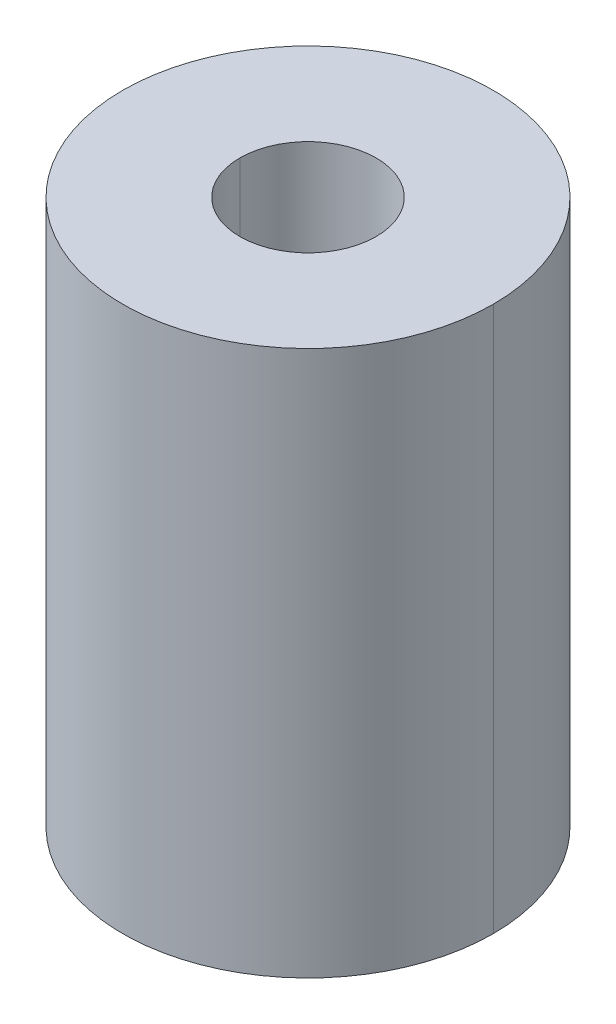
ISO-10303-21;
HEADER;
FILE_DESCRIPTION(('STEP AP214'),'2;1');
FILE_NAME('part.step','',(''),(''),'','','');
FILE_SCHEMA(('AUTOMOTIVE_DESIGN { 1 0 10303 214 1 1 1 1 }'));
ENDSEC;
DATA;
#1=APPLICATION_CONTEXT('core data for automotive mechanical design processes');
#2=APPLICATION_PROTOCOL_DEFINITION('international standard','automotive_design',2000,#1);
#3=PRODUCT_CONTEXT('',#1,'mechanical');
#4=PRODUCT('Part','Part','',(#3));
#5=PRODUCT_RELATED_PRODUCT_CATEGORY('part','',(#4));
#6=PRODUCT_DEFINITION_FORMATION('','',#4);
#7=PRODUCT_DEFINITION_CONTEXT('part definition',#1,'design');
#8=PRODUCT_DEFINITION('design','',#6,#7);
#9=PRODUCT_DEFINITION_SHAPE('','',#8);
#10=(LENGTH_UNIT() NAMED_UNIT(*) SI_UNIT(.MILLI.,.METRE.));
#11=(NAMED_UNIT(*) PLANE_ANGLE_UNIT() SI_UNIT($,.RADIAN.));
#12=(NAMED_UNIT(*) SI_UNIT($,.STERADIAN.) SOLID_ANGLE_UNIT());
#13=UNCERTAINTY_MEASURE_WITH_UNIT(LENGTH_MEASURE(1.E-05),#10,'distance_accuracy_value','');
#14=(GEOMETRIC_REPRESENTATION_CONTEXT(3) GLOBAL_UNCERTAINTY_ASSIGNED_CONTEXT((#13)) GLOBAL_UNIT_ASSIGNED_CONTEXT((#10,
#11,#12)) REPRESENTATION_CONTEXT('',''));
#15=CARTESIAN_POINT('',(0.,0.,0.));
#16=DIRECTION('',(0.,0.,1.));
#17=DIRECTION('',(1.,0.,0.));
#18=AXIS2_PLACEMENT_3D('',#15,#16,#17);
#19=CARTESIAN_POINT('',(0.,6.35,0.));
#20=DIRECTION('',(0.,-1.,0.));
#21=DIRECTION('',(0.,0.,-1.));
#22=AXIS2_PLACEMENT_3D('',#19,#20,#21);
#23=PLANE('',#22);
#24=CARTESIAN_POINT('',(0.,6.35,0.));
#25=DIRECTION('',(0.,-1.,0.));
#26=DIRECTION('',(0.,0.,-1.));
#27=AXIS2_PLACEMENT_3D('',#24,#25,#26);
#28=CIRCLE('',#27,6.35);
#29=CARTESIAN_POINT('',(6.35,6.35,0.));
#30=VERTEX_POINT('',#29);
#31=CARTESIAN_POINT('',(-6.35,6.35,0.));
#32=VERTEX_POINT('',#31);
#33=EDGE_CURVE('E66',#30,#32,#28,.F.);
#34=ORIENTED_EDGE('',*,*,#33,.T.);
#35=CARTESIAN_POINT('',(0.,6.35,0.));
#36=DIRECTION('',(0.,-1.,0.));
#37=DIRECTION('',(0.,0.,-1.));
#38=AXIS2_PLACEMENT_3D('',#35,#36,#37);
#39=CIRCLE('',#38,6.35);
#40=EDGE_CURVE('E19',#32,#30,#39,.F.);
#41=ORIENTED_EDGE('',*,*,#40,.T.);
#42=EDGE_LOOP('',(#34,#41));
#43=FACE_BOUND('',#42,.T.);
#44=ADVANCED_FACE('F16',(#43),#23,.F.);
#45=CARTESIAN_POINT('',(0.,-6.35,0.));
#46=DIRECTION('',(0.,1.,0.));
#47=DIRECTION('',(0.,0.,1.));
#48=AXIS2_PLACEMENT_3D('',#45,#46,#47);
#49=PLANE('',#48);
#50=CARTESIAN_POINT('',(0.,-6.35,0.));
#51=DIRECTION('',(0.,-1.,0.));
#52=DIRECTION('',(0.,0.,-1.));
#53=AXIS2_PLACEMENT_3D('',#50,#51,#52);
#54=CIRCLE('',#53,6.35);
#55=CARTESIAN_POINT('',(6.35,-6.35,0.));
#56=VERTEX_POINT('',#55);
#57=CARTESIAN_POINT('',(-6.35,-6.35,0.));
#58=VERTEX_POINT('',#57);
#59=EDGE_CURVE('E86',#56,#58,#54,.T.);
#60=ORIENTED_EDGE('',*,*,#59,.T.);
#61=CARTESIAN_POINT('',(0.,-6.35,0.));
#62=DIRECTION('',(0.,-1.,0.));
#63=DIRECTION('',(0.,0.,-1.));
#64=AXIS2_PLACEMENT_3D('',#61,#62,#63);
#65=CIRCLE('',#64,6.35);
#66=EDGE_CURVE('E79',#58,#56,#65,.T.);
#67=ORIENTED_EDGE('',*,*,#66,.T.);
#68=EDGE_LOOP('',(#60,#67));
#69=FACE_BOUND('',#68,.T.);
#70=ADVANCED_FACE('F149',(#69),#49,.F.);
#71=CARTESIAN_POINT('',(0.,15.875,0.));
#72=DIRECTION('',(0.,-1.,0.));
#73=DIRECTION('',(0.,0.,-1.));
#74=AXIS2_PLACEMENT_3D('',#71,#72,#73);
#75=CYLINDRICAL_SURFACE('',#74,6.35);
#76=ORIENTED_EDGE('',*,*,#40,.F.);
#77=DIRECTION('',(0.,-1.,0.));
#78=VECTOR('',#77,1.);
#79=CARTESIAN_POINT('',(-6.35,15.875,0.));
#80=LINE('',#79,#78);
#81=CARTESIAN_POINT('',(-6.35,25.4,0.));
#82=VERTEX_POINT('',#81);
#83=EDGE_CURVE('E80',#32,#82,#80,.F.);
#84=ORIENTED_EDGE('',*,*,#83,.T.);
#85=CARTESIAN_POINT('',(0.,25.4,0.));
#86=DIRECTION('',(0.,-1.,0.));
#87=DIRECTION('',(0.,0.,-1.));
#88=AXIS2_PLACEMENT_3D('',#85,#86,#87);
#89=CIRCLE('',#88,6.35);
#90=CARTESIAN_POINT('',(6.35,25.4,0.));
#91=VERTEX_POINT('',#90);
#92=EDGE_CURVE('E75',#91,#82,#89,.T.);
#93=ORIENTED_EDGE('',*,*,#92,.F.);
#94=DIRECTION('',(0.,-1.,0.));
#95=VECTOR('',#94,1.);
#96=CARTESIAN_POINT('',(6.35,15.875,0.));
#97=LINE('',#96,#95);
#98=EDGE_CURVE('E72',#91,#30,#97,.T.);
#99=ORIENTED_EDGE('',*,*,#98,.T.);
#100=EDGE_LOOP('',(#76,#84,#93,#99));
#101=FACE_BOUND('',#100,.T.);
#102=ADVANCED_FACE('F73',(#101),#75,.F.);
#103=CARTESIAN_POINT('',(0.,15.875,0.));
#104=DIRECTION('',(0.,-1.,0.));
#105=DIRECTION('',(0.,0.,-1.));
#106=AXIS2_PLACEMENT_3D('',#103,#104,#105);
#107=CYLINDRICAL_SURFACE('',#106,6.35);
#108=CARTESIAN_POINT('',(0.,25.4,0.));
#109=DIRECTION('',(0.,-1.,0.));
#110=DIRECTION('',(0.,0.,-1.));
#111=AXIS2_PLACEMENT_3D('',#108,#109,#110);
#112=CIRCLE('',#111,6.35);
#113=EDGE_CURVE('E90',#82,#91,#112,.T.);
#114=ORIENTED_EDGE('',*,*,#113,.F.);
#115=ORIENTED_EDGE('',*,*,#83,.F.);
#116=ORIENTED_EDGE('',*,*,#33,.F.);
#117=ORIENTED_EDGE('',*,*,#98,.F.);
#118=EDGE_LOOP('',(#114,#115,#116,#117));
#119=FACE_BOUND('',#118,.T.);
#120=ADVANCED_FACE('F82',(#119),#107,.F.);
#121=CARTESIAN_POINT('',(0.,-15.875,0.));
#122=DIRECTION('',(0.,-1.,0.));
#123=DIRECTION('',(0.,0.,-1.));
#124=AXIS2_PLACEMENT_3D('',#121,#122,#123);
#125=CYLINDRICAL_SURFACE('',#124,6.35);
#126=ORIENTED_EDGE('',*,*,#66,.F.);
#127=DIRECTION('',(0.,-1.,0.));
#128=VECTOR('',#127,1.);
#129=CARTESIAN_POINT('',(-6.35,-15.875,0.));
#130=LINE('',#129,#128);
#131=CARTESIAN_POINT('',(-6.35,-25.4,0.));
#132=VERTEX_POINT('',#131);
#133=EDGE_CURVE('E88',#58,#132,#130,.T.);
#134=ORIENTED_EDGE('',*,*,#133,.T.);
#135=CARTESIAN_POINT('',(0.,-25.4,0.));
#136=DIRECTION('',(0.,-1.,0.));
#137=DIRECTION('',(0.,0.,-1.));
#138=AXIS2_PLACEMENT_3D('',#135,#136,#137);
#139=CIRCLE('',#138,6.35);
#140=CARTESIAN_POINT('',(6.35,-25.4,0.));
#141=VERTEX_POINT('',#140);
#142=EDGE_CURVE('E95',#141,#132,#139,.F.);
#143=ORIENTED_EDGE('',*,*,#142,.F.);
#144=DIRECTION('',(0.,-1.,0.));
#145=VECTOR('',#144,1.);
#146=CARTESIAN_POINT('',(6.35,-15.875,0.));
#147=LINE('',#146,#145);
#148=EDGE_CURVE('E91',#141,#56,#147,.F.);
#149=ORIENTED_EDGE('',*,*,#148,.T.);
#150=EDGE_LOOP('',(#126,#134,#143,#149));
#151=FACE_BOUND('',#150,.T.);
#152=ADVANCED_FACE('F129',(#151),#125,.F.);
#153=CARTESIAN_POINT('',(0.,-15.875,0.));
#154=DIRECTION('',(0.,-1.,0.));
#155=DIRECTION('',(0.,0.,-1.));
#156=AXIS2_PLACEMENT_3D('',#153,#154,#155);
#157=CYLINDRICAL_SURFACE('',#156,6.35);
#158=CARTESIAN_POINT('',(0.,-25.4,0.));
#159=DIRECTION('',(0.,-1.,0.));
#160=DIRECTION('',(0.,0.,-1.));
#161=AXIS2_PLACEMENT_3D('',#158,#159,#160);
#162=CIRCLE('',#161,6.35);
#163=EDGE_CURVE('E98',#132,#141,#162,.F.);
#164=ORIENTED_EDGE('',*,*,#163,.F.);
#165=ORIENTED_EDGE('',*,*,#133,.F.);
#166=ORIENTED_EDGE('',*,*,#59,.F.);
#167=ORIENTED_EDGE('',*,*,#148,.F.);
#168=EDGE_LOOP('',(#164,#165,#166,#167));
#169=FACE_BOUND('',#168,.T.);
#170=ADVANCED_FACE('F120',(#169),#157,.F.);
#171=CARTESIAN_POINT('',(0.,25.4,0.));
#172=DIRECTION('',(0.,1.,0.));
#173=DIRECTION('',(0.,0.,1.));
#174=AXIS2_PLACEMENT_3D('',#171,#172,#173);
#175=PLANE('',#174);
#176=CARTESIAN_POINT('',(0.,25.4,0.));
#177=DIRECTION('',(0.,-1.,0.));
#178=DIRECTION('',(0.,0.,-1.));
#179=AXIS2_PLACEMENT_3D('',#176,#177,#178);
#180=CIRCLE('',#179,17.2640625);
#181=CARTESIAN_POINT('',(-17.2640625,25.4,0.));
#182=VERTEX_POINT('',#181);
#183=CARTESIAN_POINT('',(17.2640625,25.4,0.));
#184=VERTEX_POINT('',#183);
#185=EDGE_CURVE('E93',#182,#184,#180,.T.);
#186=ORIENTED_EDGE('',*,*,#185,.F.);
#187=CARTESIAN_POINT('',(0.,25.4,0.));
#188=DIRECTION('',(0.,-1.,0.));
#189=DIRECTION('',(0.,0.,-1.));
#190=AXIS2_PLACEMENT_3D('',#187,#188,#189);
#191=CIRCLE('',#190,17.2640625);
#192=EDGE_CURVE('E103',#184,#182,#191,.T.);
#193=ORIENTED_EDGE('',*,*,#192,.F.);
#194=EDGE_LOOP('',(#186,#193));
#195=FACE_BOUND('',#194,.T.);
#196=ORIENTED_EDGE('',*,*,#92,.T.);
#197=ORIENTED_EDGE('',*,*,#113,.T.);
#198=EDGE_LOOP('',(#196,#197));
#199=FACE_BOUND('',#198,.T.);
#200=ADVANCED_FACE('F117',(#195,#199),#175,.T.);
#201=CARTESIAN_POINT('',(0.,0.,0.));
#202=DIRECTION('',(0.,-1.,0.));
#203=DIRECTION('',(0.,0.,-1.));
#204=AXIS2_PLACEMENT_3D('',#201,#202,#203);
#205=CYLINDRICAL_SURFACE('',#204,17.2640625);
#206=DIRECTION('',(0.,-1.,0.));
#207=VECTOR('',#206,1.);
#208=CARTESIAN_POINT('',(-17.2640625,0.,0.));
#209=LINE('',#208,#207);
#210=CARTESIAN_POINT('',(-17.2640625,-25.4,0.));
#211=VERTEX_POINT('',#210);
#212=EDGE_CURVE('E25',#182,#211,#209,.T.);
#213=ORIENTED_EDGE('',*,*,#212,.F.);
#214=ORIENTED_EDGE('',*,*,#185,.T.);
#215=DIRECTION('',(0.,-1.,0.));
#216=VECTOR('',#215,1.);
#217=CARTESIAN_POINT('',(17.2640625,0.,0.));
#218=LINE('',#217,#216);
#219=CARTESIAN_POINT('',(17.2640625,-25.4,0.));
#220=VERTEX_POINT('',#219);
#221=EDGE_CURVE('E102',#220,#184,#218,.F.);
#222=ORIENTED_EDGE('',*,*,#221,.F.);
#223=CARTESIAN_POINT('',(0.,-25.4,0.));
#224=DIRECTION('',(0.,-1.,0.));
#225=DIRECTION('',(0.,0.,-1.));
#226=AXIS2_PLACEMENT_3D('',#223,#224,#225);
#227=CIRCLE('',#226,17.2640625);
#228=EDGE_CURVE('E34',#211,#220,#227,.T.);
#229=ORIENTED_EDGE('',*,*,#228,.F.);
#230=EDGE_LOOP('',(#213,#214,#222,#229));
#231=FACE_BOUND('',#230,.T.);
#232=ADVANCED_FACE('F115',(#231),#205,.T.);
#233=CARTESIAN_POINT('',(0.,-25.4,0.));
#234=DIRECTION('',(0.,-1.,0.));
#235=DIRECTION('',(0.,0.,-1.));
#236=AXIS2_PLACEMENT_3D('',#233,#234,#235);
#237=PLANE('',#236);
#238=CARTESIAN_POINT('',(0.,-25.4,0.));
#239=DIRECTION('',(0.,-1.,0.));
#240=DIRECTION('',(0.,0.,-1.));
#241=AXIS2_PLACEMENT_3D('',#238,#239,#240);
#242=CIRCLE('',#241,17.2640625);
#243=EDGE_CURVE('E11',#211,#220,#242,.F.);
#244=ORIENTED_EDGE('',*,*,#243,.F.);
#245=ORIENTED_EDGE('',*,*,#228,.T.);
#246=EDGE_LOOP('',(#244,#245));
#247=FACE_BOUND('',#246,.T.);
#248=ORIENTED_EDGE('',*,*,#142,.T.);
#249=ORIENTED_EDGE('',*,*,#163,.T.);
#250=EDGE_LOOP('',(#248,#249));
#251=FACE_BOUND('',#250,.T.);
#252=ADVANCED_FACE('F127',(#247,#251),#237,.T.);
#253=CARTESIAN_POINT('',(0.,0.,0.));
#254=DIRECTION('',(0.,-1.,0.));
#255=DIRECTION('',(0.,0.,-1.));
#256=AXIS2_PLACEMENT_3D('',#253,#254,#255);
#257=CYLINDRICAL_SURFACE('',#256,17.2640625);
#258=ORIENTED_EDGE('',*,*,#212,.T.);
#259=ORIENTED_EDGE('',*,*,#243,.T.);
#260=ORIENTED_EDGE('',*,*,#221,.T.);
#261=ORIENTED_EDGE('',*,*,#192,.T.);
#262=EDGE_LOOP('',(#258,#259,#260,#261));
#263=FACE_BOUND('',#262,.T.);
#264=ADVANCED_FACE('F113',(#263),#257,.T.);
#265=CLOSED_SHELL('',(#44,#70,#102,#120,#152,#170,#200,#232,#252,#264));
#266=MANIFOLD_SOLID_BREP('B1',#265);
#267=ADVANCED_BREP_SHAPE_REPRESENTATION('',(#18,#266),#14);
#268=SHAPE_DEFINITION_REPRESENTATION(#9,#267);
ENDSEC;
END-ISO-10303-21;
